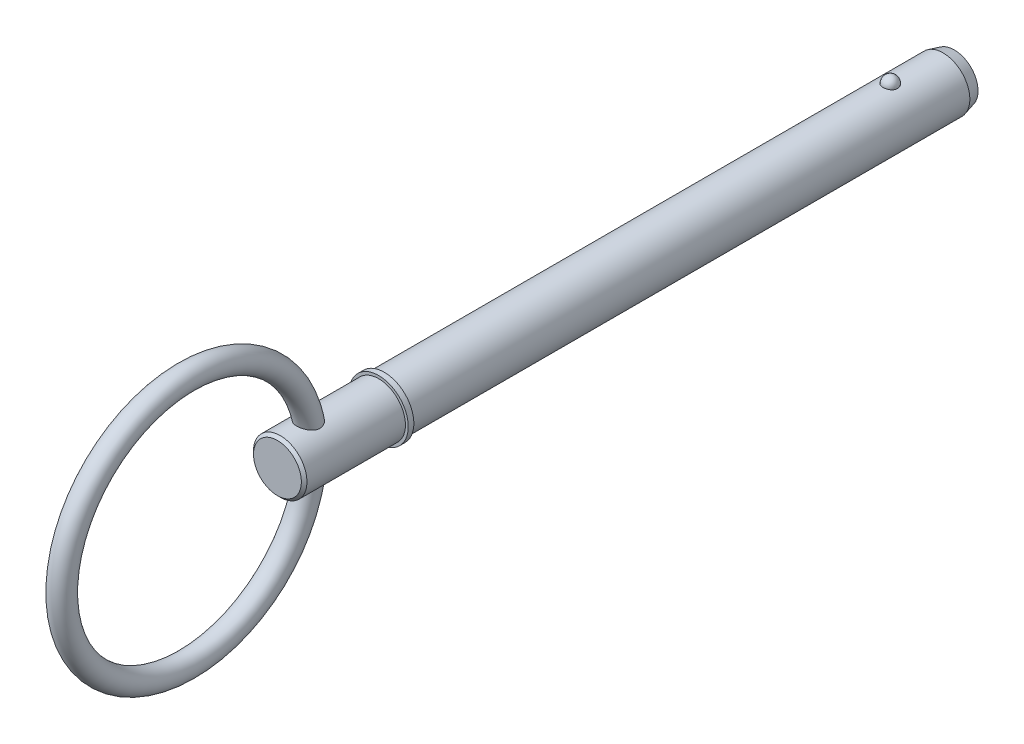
ISO-10303-21;
HEADER;
FILE_DESCRIPTION(('STEP AP214'),'2;1');
FILE_NAME('part.step','',(''),(''),'','','');
FILE_SCHEMA(('AUTOMOTIVE_DESIGN { 1 0 10303 214 1 1 1 1 }'));
ENDSEC;
DATA;
#1=APPLICATION_CONTEXT('core data for automotive mechanical design processes');
#2=APPLICATION_PROTOCOL_DEFINITION('international standard','automotive_design',2000,#1);
#3=PRODUCT_CONTEXT('',#1,'mechanical');
#4=PRODUCT('Part','Part','',(#3));
#5=PRODUCT_RELATED_PRODUCT_CATEGORY('part','',(#4));
#6=PRODUCT_DEFINITION_FORMATION('','',#4);
#7=PRODUCT_DEFINITION_CONTEXT('part definition',#1,'design');
#8=PRODUCT_DEFINITION('design','',#6,#7);
#9=PRODUCT_DEFINITION_SHAPE('','',#8);
#10=(LENGTH_UNIT() NAMED_UNIT(*) SI_UNIT(.MILLI.,.METRE.));
#11=(NAMED_UNIT(*) PLANE_ANGLE_UNIT() SI_UNIT($,.RADIAN.));
#12=(NAMED_UNIT(*) SI_UNIT($,.STERADIAN.) SOLID_ANGLE_UNIT());
#13=UNCERTAINTY_MEASURE_WITH_UNIT(LENGTH_MEASURE(1.E-05),#10,'distance_accuracy_value','');
#14=(GEOMETRIC_REPRESENTATION_CONTEXT(3) GLOBAL_UNCERTAINTY_ASSIGNED_CONTEXT((#13)) GLOBAL_UNIT_ASSIGNED_CONTEXT((#10,
#11,#12)) REPRESENTATION_CONTEXT('',''));
#15=CARTESIAN_POINT('',(0.,0.,0.));
#16=DIRECTION('',(0.,0.,1.));
#17=DIRECTION('',(1.,0.,0.));
#18=AXIS2_PLACEMENT_3D('',#15,#16,#17);
#19=CARTESIAN_POINT('',(0.,0.,88.9));
#20=DIRECTION('',(0.,0.,-1.));
#21=DIRECTION('',(-1.,0.,0.));
#22=AXIS2_PLACEMENT_3D('',#19,#20,#21);
#23=CYLINDRICAL_SURFACE('',#22,4.765);
#24=CARTESIAN_POINT('',(1.27812710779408,4.59038300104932,-1.29));
#25=CARTESIAN_POINT('',(1.27812572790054,4.59038414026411,-1.2178688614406));
#26=CARTESIAN_POINT('',(1.27223018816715,4.59203736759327,-1.14572000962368));
#27=CARTESIAN_POINT('',(1.24878929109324,4.59846646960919,-1.00346315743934));
#28=CARTESIAN_POINT('',(1.23123896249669,4.60324367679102,-0.933356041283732));
#29=CARTESIAN_POINT('',(1.18493861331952,4.61537801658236,-0.797215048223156));
#30=CARTESIAN_POINT('',(1.15619354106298,4.62273400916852,-0.731179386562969));
#31=CARTESIAN_POINT('',(1.08822596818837,4.6392032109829,-0.604986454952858));
#32=CARTESIAN_POINT('',(1.04900384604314,4.64831635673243,-0.544828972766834));
#33=CARTESIAN_POINT('',(0.960865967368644,4.66733302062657,-0.431775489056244));
#34=CARTESIAN_POINT('',(0.911906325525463,4.67723999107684,-0.378914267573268));
#35=CARTESIAN_POINT('',(0.805678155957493,4.69670280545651,-0.282245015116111));
#36=CARTESIAN_POINT('',(0.748409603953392,4.70625864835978,-0.238437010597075));
#37=CARTESIAN_POINT('',(0.627266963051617,4.72392767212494,-0.161207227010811));
#38=CARTESIAN_POINT('',(0.563411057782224,4.73204466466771,-0.127757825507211));
#39=CARTESIAN_POINT('',(0.430755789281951,4.74595788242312,-0.0720471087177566));
#40=CARTESIAN_POINT('',(0.361956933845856,4.75175434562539,-0.0497846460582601));
#41=CARTESIAN_POINT('',(0.222605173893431,4.76030056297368,-0.0173750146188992));
#42=CARTESIAN_POINT('',(0.152101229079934,4.76309991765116,-0.00703038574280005));
#43=CARTESIAN_POINT('',(0.0103009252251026,4.76551622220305,0.00191361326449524));
#44=CARTESIAN_POINT('',(-0.0609953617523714,4.76513345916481,0.000514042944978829));
#45=CARTESIAN_POINT('',(-0.201348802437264,4.76125496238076,-0.0138891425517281));
#46=CARTESIAN_POINT('',(-0.270423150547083,4.75780093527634,-0.0267372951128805));
#47=CARTESIAN_POINT('',(-0.405377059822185,4.74820737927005,-0.0634598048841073));
#48=CARTESIAN_POINT('',(-0.471256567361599,4.74206780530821,-0.0873343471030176));
#49=CARTESIAN_POINT('',(-0.598375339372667,4.72771507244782,-0.145611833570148));
#50=CARTESIAN_POINT('',(-0.659587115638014,4.71949070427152,-0.180071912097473));
#51=CARTESIAN_POINT('',(-0.775356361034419,4.70185936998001,-0.258542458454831));
#52=CARTESIAN_POINT('',(-0.8299131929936,4.69245229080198,-0.302553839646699));
#53=CARTESIAN_POINT('',(-0.931895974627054,4.67327936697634,-0.399829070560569));
#54=CARTESIAN_POINT('',(-0.979176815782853,4.66351011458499,-0.453244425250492));
#55=CARTESIAN_POINT('',(-1.06421220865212,4.64484426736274,-0.567321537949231));
#56=CARTESIAN_POINT('',(-1.10196613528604,4.63594772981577,-0.627983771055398));
#57=CARTESIAN_POINT('',(-1.16735225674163,4.61992036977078,-0.755585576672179));
#58=CARTESIAN_POINT('',(-1.19487251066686,4.61280933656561,-0.822585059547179));
#59=CARTESIAN_POINT('',(-1.23851975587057,4.60128324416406,-0.960417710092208));
#60=CARTESIAN_POINT('',(-1.25464705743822,4.59686811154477,-1.03125077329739));
#61=CARTESIAN_POINT('',(-1.27505790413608,4.59124882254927,-1.17443804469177));
#62=CARTESIAN_POINT('',(-1.27938868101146,4.59003186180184,-1.24678501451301));
#63=CARTESIAN_POINT('',(-1.27623192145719,4.5909105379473,-1.3911989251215));
#64=CARTESIAN_POINT('',(-1.26874468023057,4.59300609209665,-1.46326587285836));
#65=CARTESIAN_POINT('',(-1.24220427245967,4.60025423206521,-1.60473192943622));
#66=CARTESIAN_POINT('',(-1.2232043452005,4.60539274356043,-1.67414176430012));
#67=CARTESIAN_POINT('',(-1.17415910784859,4.61813957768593,-1.80870154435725));
#68=CARTESIAN_POINT('',(-1.1441133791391,4.62574799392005,-1.87385132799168));
#69=CARTESIAN_POINT('',(-1.07354327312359,4.64263368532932,-1.99841604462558));
#70=CARTESIAN_POINT('',(-1.03296580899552,4.65191934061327,-2.05779976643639));
#71=CARTESIAN_POINT('',(-0.942433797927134,4.67110036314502,-2.16881966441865));
#72=CARTESIAN_POINT('',(-0.892478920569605,4.68099575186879,-2.22045556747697));
#73=CARTESIAN_POINT('',(-0.784302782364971,4.70033161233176,-2.31471696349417));
#74=CARTESIAN_POINT('',(-0.726054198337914,4.70977043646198,-2.35731146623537));
#75=CARTESIAN_POINT('',(-0.602997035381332,4.72709995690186,-2.43206620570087));
#76=CARTESIAN_POINT('',(-0.538188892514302,4.73499075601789,-2.46422713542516));
#77=CARTESIAN_POINT('',(-0.404639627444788,4.7482563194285,-2.51687454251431));
#78=CARTESIAN_POINT('',(-0.335953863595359,4.7536596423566,-2.53749415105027));
#79=CARTESIAN_POINT('',(-0.195948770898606,4.76148510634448,-2.56703727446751));
#80=CARTESIAN_POINT('',(-0.124629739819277,4.76390758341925,-2.57596210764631));
#81=CARTESIAN_POINT('',(0.0172696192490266,4.76548774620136,-2.58180339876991));
#82=CARTESIAN_POINT('',(0.0878407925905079,4.76470225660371,-2.57892886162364));
#83=CARTESIAN_POINT('',(0.227467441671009,4.76008019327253,-2.56172603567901));
#84=CARTESIAN_POINT('',(0.296522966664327,4.75624371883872,-2.54739811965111));
#85=CARTESIAN_POINT('',(0.430942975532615,4.74595041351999,-2.50776251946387));
#86=CARTESIAN_POINT('',(0.496319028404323,4.7395023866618,-2.4824917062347));
#87=CARTESIAN_POINT('',(0.621860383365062,4.72467083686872,-2.4216730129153));
#88=CARTESIAN_POINT('',(0.682025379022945,4.71628720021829,-2.38612452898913));
#89=CARTESIAN_POINT('',(0.796409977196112,4.69833598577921,-2.30511163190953));
#90=CARTESIAN_POINT('',(0.850529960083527,4.68875291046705,-2.25951003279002));
#91=CARTESIAN_POINT('',(0.950412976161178,4.66953243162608,-2.15992428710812));
#92=CARTESIAN_POINT('',(0.996174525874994,4.65989501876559,-2.10593865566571));
#93=CARTESIAN_POINT('',(1.07885962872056,4.64145616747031,-1.99009376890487));
#94=CARTESIAN_POINT('',(1.11562789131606,4.63267081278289,-1.92812106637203));
#95=CARTESIAN_POINT('',(1.17840570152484,4.61710269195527,-1.79873681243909));
#96=CARTESIAN_POINT('',(1.20441973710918,4.61031909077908,-1.73132754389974));
#97=CARTESIAN_POINT('',(1.24242116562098,4.60021170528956,-1.60192906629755));
#98=CARTESIAN_POINT('',(1.25578772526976,4.59655387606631,-1.54036674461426));
#99=CARTESIAN_POINT('',(1.27364121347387,4.59163904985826,-1.41587409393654));
#100=CARTESIAN_POINT('',(1.2781283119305,4.59038200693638,-1.35294379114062));
#101=CARTESIAN_POINT('',(1.27812710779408,4.59038300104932,-1.29));
#102=B_SPLINE_CURVE_WITH_KNOTS('',3,(#24,#25,#26,#27,#28,#29,#30,#31,#32,#33,#34,#35,#36,#37,
#38,#39,#40,#41,#42,#43,#44,#45,#46,#47,#48,#49,#50,#51,#52,#53,#54,#55,#56,#57,#58,#59,#60,#61,
#62,#63,#64,#65,#66,#67,#68,#69,#70,#71,#72,#73,#74,#75,#76,#77,#78,#79,#80,#81,#82,#83,#84,#85,
#86,#87,#88,#89,#90,#91,#92,#93,#94,#95,#96,#97,#98,#99,#100,#101),.UNSPECIFIED.,.T.,.F.,(4,2,2,
2,2,2,2,2,2,2,2,2,2,2,2,2,2,2,2,2,2,2,2,2,2,2,2,2,2,2,2,2,2,2,2,2,2,2,4),(0.,0.216167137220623,
0.432426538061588,0.648590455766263,0.864746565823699,1.0818998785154,1.29905382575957,
1.51562361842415,1.73217119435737,1.94507683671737,2.15796327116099,2.36800220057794,
2.57804465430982,2.78924132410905,3.00045819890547,3.21545551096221,3.43046692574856,
3.64776550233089,3.8650581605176,4.08147951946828,4.29789547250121,4.51331818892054,
4.72874907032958,4.94528769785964,5.16183395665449,5.37911087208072,5.59637335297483,
5.8110751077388,6.02575265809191,6.23664413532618,6.44752874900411,6.65770827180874,
6.86790014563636,7.08116060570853,7.29445887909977,7.51121476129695,7.72788009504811,
7.91651762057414,8.10515153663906),.UNSPECIFIED.);
#103=CARTESIAN_POINT('',(1.27812710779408,4.59038300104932,-1.29));
#104=VERTEX_POINT('',#103);
#105=EDGE_CURVE('E102',#104,#104,#102,.T.);
#106=ORIENTED_EDGE('',*,*,#105,.T.);
#107=EDGE_LOOP('',(#106));
#108=FACE_BOUND('',#107,.T.);
#109=CARTESIAN_POINT('',(0.,0.,-10.7));
#110=DIRECTION('',(0.,0.,-1.));
#111=DIRECTION('',(-1.,0.,0.));
#112=AXIS2_PLACEMENT_3D('',#109,#110,#111);
#113=CIRCLE('',#112,4.765);
#114=CARTESIAN_POINT('',(-4.765,0.,-10.7));
#115=VERTEX_POINT('',#114);
#116=EDGE_CURVE('E110',#115,#115,#113,.F.);
#117=ORIENTED_EDGE('',*,*,#116,.T.);
#118=EDGE_LOOP('',(#117));
#119=FACE_BOUND('',#118,.T.);
#120=CARTESIAN_POINT('',(0.,0.,88.9));
#121=DIRECTION('',(0.,0.,1.));
#122=DIRECTION('',(1.,0.,0.));
#123=AXIS2_PLACEMENT_3D('',#120,#121,#122);
#124=CIRCLE('',#123,4.765);
#125=CARTESIAN_POINT('',(4.765,0.,88.9));
#126=VERTEX_POINT('',#125);
#127=EDGE_CURVE('E108',#126,#126,#124,.T.);
#128=ORIENTED_EDGE('',*,*,#127,.F.);
#129=EDGE_LOOP('',(#128));
#130=FACE_BOUND('',#129,.T.);
#131=ADVANCED_FACE('F39',(#108,#119,#130),#23,.T.);
#132=CARTESIAN_POINT('',(0.,0.,-12.7));
#133=DIRECTION('',(0.,0.,-1.));
#134=DIRECTION('',(-1.,0.,0.));
#135=AXIS2_PLACEMENT_3D('',#132,#133,#134);
#136=PLANE('',#135);
#137=CARTESIAN_POINT('',(0.,0.,-12.7));
#138=DIRECTION('',(0.,0.,-1.));
#139=DIRECTION('',(-1.,0.,0.));
#140=AXIS2_PLACEMENT_3D('',#137,#138,#139);
#141=CIRCLE('',#140,4.22910161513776);
#142=CARTESIAN_POINT('',(-4.22910161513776,0.,-12.7));
#143=VERTEX_POINT('',#142);
#144=EDGE_CURVE('E143',#143,#143,#141,.T.);
#145=ORIENTED_EDGE('',*,*,#144,.T.);
#146=EDGE_LOOP('',(#145));
#147=FACE_BOUND('',#146,.T.);
#148=ADVANCED_FACE('F88',(#147),#136,.T.);
#149=CARTESIAN_POINT('',(0.,0.,-12.7));
#150=DIRECTION('',(0.,0.,1.));
#151=DIRECTION('',(1.,0.,0.));
#152=AXIS2_PLACEMENT_3D('',#149,#150,#151);
#153=CONICAL_SURFACE('',#152,4.22910161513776,0.261799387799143);
#154=ORIENTED_EDGE('',*,*,#116,.F.);
#155=EDGE_LOOP('',(#154));
#156=FACE_BOUND('',#155,.T.);
#157=ORIENTED_EDGE('',*,*,#144,.F.);
#158=EDGE_LOOP('',(#157));
#159=FACE_BOUND('',#158,.T.);
#160=ADVANCED_FACE('F94',(#156,#159),#153,.T.);
#161=CARTESIAN_POINT('',(0.,4.765,-1.29));
#162=DIRECTION('',(0.,1.,0.));
#163=DIRECTION('',(0.,0.,-1.));
#164=AXIS2_PLACEMENT_3D('',#161,#162,#163);
#165=SPHERICAL_SURFACE('',#164,1.29);
#166=ORIENTED_EDGE('',*,*,#105,.F.);
#167=EDGE_LOOP('',(#166));
#168=FACE_BOUND('',#167,.T.);
#169=ADVANCED_FACE('F113',(#168),#165,.T.);
#170=CARTESIAN_POINT('',(0.,0.,88.9));
#171=DIRECTION('',(0.,0.,-1.));
#172=DIRECTION('',(-1.,0.,0.));
#173=AXIS2_PLACEMENT_3D('',#170,#171,#172);
#174=PLANE('',#173);
#175=ORIENTED_EDGE('',*,*,#127,.T.);
#176=EDGE_LOOP('',(#175));
#177=FACE_BOUND('',#176,.T.);
#178=CARTESIAN_POINT('',(0.,0.,88.9));
#179=DIRECTION('',(0.,0.,-1.));
#180=DIRECTION('',(-1.,0.,0.));
#181=AXIS2_PLACEMENT_3D('',#178,#179,#180);
#182=CIRCLE('',#181,5.265);
#183=CARTESIAN_POINT('',(-5.265,0.,88.9));
#184=VERTEX_POINT('',#183);
#185=EDGE_CURVE('E109',#184,#184,#182,.T.);
#186=ORIENTED_EDGE('',*,*,#185,.T.);
#187=EDGE_LOOP('',(#186));
#188=FACE_BOUND('',#187,.T.);
#189=ADVANCED_FACE('F117',(#177,#188),#174,.T.);
#190=CARTESIAN_POINT('',(0.,0.,33.7287874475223));
#191=DIRECTION('',(0.,0.,-1.));
#192=DIRECTION('',(-1.,0.,0.));
#193=AXIS2_PLACEMENT_3D('',#190,#191,#192);
#194=CYLINDRICAL_SURFACE('',#193,5.265);
#195=CARTESIAN_POINT('',(0.,0.,89.9));
#196=DIRECTION('',(0.,0.,-1.));
#197=DIRECTION('',(-1.,0.,0.));
#198=AXIS2_PLACEMENT_3D('',#195,#196,#197);
#199=CIRCLE('',#198,5.265);
#200=CARTESIAN_POINT('',(-5.265,0.,89.9));
#201=VERTEX_POINT('',#200);
#202=EDGE_CURVE('E134',#201,#201,#199,.T.);
#203=ORIENTED_EDGE('',*,*,#202,.T.);
#204=EDGE_LOOP('',(#203));
#205=FACE_BOUND('',#204,.T.);
#206=ORIENTED_EDGE('',*,*,#185,.F.);
#207=EDGE_LOOP('',(#206));
#208=FACE_BOUND('',#207,.T.);
#209=ADVANCED_FACE('F121',(#205,#208),#194,.T.);
#210=CARTESIAN_POINT('',(0.,5.265,89.9));
#211=DIRECTION('',(0.,0.,1.));
#212=DIRECTION('',(1.,0.,0.));
#213=AXIS2_PLACEMENT_3D('',#210,#211,#212);
#214=PLANE('',#213);
#215=CARTESIAN_POINT('',(0.,0.,89.9));
#216=DIRECTION('',(0.,0.,1.));
#217=DIRECTION('',(1.,0.,0.));
#218=AXIS2_PLACEMENT_3D('',#215,#216,#217);
#219=CIRCLE('',#218,4.765);
#220=CARTESIAN_POINT('',(4.765,0.,89.9));
#221=VERTEX_POINT('',#220);
#222=EDGE_CURVE('E112',#221,#221,#219,.T.);
#223=ORIENTED_EDGE('',*,*,#222,.F.);
#224=EDGE_LOOP('',(#223));
#225=FACE_BOUND('',#224,.T.);
#226=ORIENTED_EDGE('',*,*,#202,.F.);
#227=EDGE_LOOP('',(#226));
#228=FACE_BOUND('',#227,.T.);
#229=ADVANCED_FACE('F85',(#225,#228),#214,.T.);
#230=CARTESIAN_POINT('',(0.,0.,107.95));
#231=DIRECTION('',(0.,0.,-1.));
#232=DIRECTION('',(-1.,0.,0.));
#233=AXIS2_PLACEMENT_3D('',#230,#231,#232);
#234=CYLINDRICAL_SURFACE('',#233,4.765);
#235=CARTESIAN_POINT('',(-1.17603588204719,-4.61759294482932,100.78372006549));
#236=CARTESIAN_POINT('',(-1.08605054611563,-4.6405075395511,100.7215688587));
#237=CARTESIAN_POINT('',(-0.990486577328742,-4.66202408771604,100.66673933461));
#238=CARTESIAN_POINT('',(-0.790762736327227,-4.70002969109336,100.572995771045));
#239=CARTESIAN_POINT('',(-0.686587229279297,-4.7165093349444,100.534111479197));
#240=CARTESIAN_POINT('',(-0.472539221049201,-4.7427361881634,100.473267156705));
#241=CARTESIAN_POINT('',(-0.362665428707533,-4.75248186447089,100.451310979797));
#242=CARTESIAN_POINT('',(-0.140482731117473,-4.7642267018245,100.424936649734));
#243=CARTESIAN_POINT('',(-0.0281752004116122,-4.7662301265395,100.420508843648));
#244=CARTESIAN_POINT('',(0.193745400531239,-4.76233166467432,100.429208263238));
#245=CARTESIAN_POINT('',(0.303372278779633,-4.75656024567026,100.442045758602));
#246=CARTESIAN_POINT('',(0.518724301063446,-4.73791484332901,100.484434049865));
#247=CARTESIAN_POINT('',(0.624448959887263,-4.72503997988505,100.513986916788));
#248=CARTESIAN_POINT('',(0.829434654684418,-4.69340588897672,100.58920858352));
#249=CARTESIAN_POINT('',(0.928674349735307,-4.6746283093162,100.634927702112));
#250=CARTESIAN_POINT('',(1.11777413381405,-4.63305392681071,100.741473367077));
#251=CARTESIAN_POINT('',(1.20763216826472,-4.61025624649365,100.802303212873));
#252=CARTESIAN_POINT('',(1.37762760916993,-4.56238439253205,100.939439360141));
#253=CARTESIAN_POINT('',(1.45749020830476,-4.53726959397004,101.01607281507));
#254=CARTESIAN_POINT('',(1.60275140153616,-4.48801828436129,101.182293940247));
#255=CARTESIAN_POINT('',(1.66815155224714,-4.46388166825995,101.271880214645));
#256=CARTESIAN_POINT('',(1.78162069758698,-4.41980966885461,101.460468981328));
#257=CARTESIAN_POINT('',(1.82993675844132,-4.3998162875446,101.559308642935));
#258=CARTESIAN_POINT('',(1.90902953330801,-4.36608532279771,101.764739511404));
#259=CARTESIAN_POINT('',(1.93981696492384,-4.35234391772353,101.871325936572));
#260=CARTESIAN_POINT('',(1.9818112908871,-4.33337618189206,102.082380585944));
#261=CARTESIAN_POINT('',(1.99406945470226,-4.32769391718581,102.18660066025));
#262=CARTESIAN_POINT('',(2.0025484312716,-4.32377679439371,102.395812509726));
#263=CARTESIAN_POINT('',(1.99876733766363,-4.32554282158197,102.500804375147));
#264=CARTESIAN_POINT('',(1.97595504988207,-4.33600911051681,102.709105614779));
#265=CARTESIAN_POINT('',(1.95686739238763,-4.3447350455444,102.812407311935));
#266=CARTESIAN_POINT('',(1.90457346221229,-4.36790947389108,103.014679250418));
#267=CARTESIAN_POINT('',(1.87136191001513,-4.38236010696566,103.113647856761));
#268=CARTESIAN_POINT('',(1.78747856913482,-4.41728816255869,103.316470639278));
#269=CARTESIAN_POINT('',(1.73524632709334,-4.43826528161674,103.419592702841));
#270=CARTESIAN_POINT('',(1.61607256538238,-4.48303292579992,103.616386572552));
#271=CARTESIAN_POINT('',(1.5491157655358,-4.50682636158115,103.710048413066));
#272=CARTESIAN_POINT('',(1.39359064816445,-4.55746895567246,103.895383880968));
#273=CARTESIAN_POINT('',(1.30346928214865,-4.58437060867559,103.985750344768));
#274=CARTESIAN_POINT('',(1.10794390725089,-4.6354985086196,104.149011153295));
#275=CARTESIAN_POINT('',(1.00255934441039,-4.65972809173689,104.221927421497));
#276=CARTESIAN_POINT('',(0.803761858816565,-4.69755503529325,104.332407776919));
#277=CARTESIAN_POINT('',(0.712935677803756,-4.71231838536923,104.374230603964));
#278=CARTESIAN_POINT('',(0.525172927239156,-4.73691370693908,104.442936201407));
#279=CARTESIAN_POINT('',(0.428242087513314,-4.7467502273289,104.469832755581));
#280=CARTESIAN_POINT('',(0.230351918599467,-4.76046566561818,104.50714705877));
#281=CARTESIAN_POINT('',(0.129376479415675,-4.76431768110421,104.517490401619));
#282=CARTESIAN_POINT('',(-0.0728965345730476,-4.76551495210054,104.520716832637));
#283=CARTESIAN_POINT('',(-0.174194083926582,-4.76286070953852,104.51360126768));
#284=CARTESIAN_POINT('',(-0.366467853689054,-4.751792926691,104.483579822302));
#285=CARTESIAN_POINT('',(-0.45765922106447,-4.74381187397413,104.461858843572));
#286=CARTESIAN_POINT('',(-0.635226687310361,-4.72331548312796,104.405084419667));
#287=CARTESIAN_POINT('',(-0.721601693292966,-4.71079912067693,104.370027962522));
#288=CARTESIAN_POINT('',(-0.893212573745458,-4.68139468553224,104.285559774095));
#289=CARTESIAN_POINT('',(-0.978027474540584,-4.66427939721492,104.235377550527));
#290=CARTESIAN_POINT('',(-1.13917803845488,-4.62756330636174,104.123642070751));
#291=CARTESIAN_POINT('',(-1.21550961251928,-4.6079613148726,104.062083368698));
#292=CARTESIAN_POINT('',(-1.37033540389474,-4.56452178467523,103.91868852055));
#293=CARTESIAN_POINT('',(-1.44723650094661,-4.5405070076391,103.835184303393));
#294=CARTESIAN_POINT('',(-1.58763850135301,-4.49334232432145,103.657292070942));
#295=CARTESIAN_POINT('',(-1.65112672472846,-4.47019325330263,103.562893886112));
#296=CARTESIAN_POINT('',(-1.77033243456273,-4.42444393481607,103.353206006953));
#297=CARTESIAN_POINT('',(-1.82420433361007,-4.40224259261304,103.236768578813));
#298=CARTESIAN_POINT('',(-1.91169086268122,-4.36496831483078,102.995409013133));
#299=CARTESIAN_POINT('',(-1.94531523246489,-4.34989195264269,102.870490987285));
#300=CARTESIAN_POINT('',(-1.98892523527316,-4.33012255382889,102.622016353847));
#301=CARTESIAN_POINT('',(-1.99998275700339,-4.32495941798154,102.498689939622));
#302=CARTESIAN_POINT('',(-2.00001713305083,-4.32494814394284,102.252073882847));
#303=CARTESIAN_POINT('',(-1.98902141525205,-4.33008719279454,102.128784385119));
#304=CARTESIAN_POINT('',(-1.94752572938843,-4.34888267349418,101.90321378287));
#305=CARTESIAN_POINT('',(-1.9197975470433,-4.36132278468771,101.800310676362));
#306=CARTESIAN_POINT('',(-1.84805595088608,-4.39220107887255,101.601251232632));
#307=CARTESIAN_POINT('',(-1.80403476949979,-4.4106421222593,101.505098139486));
#308=CARTESIAN_POINT('',(-1.70232000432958,-4.45086896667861,101.324457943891));
#309=CARTESIAN_POINT('',(-1.64499853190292,-4.47255887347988,101.239738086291));
#310=CARTESIAN_POINT('',(-1.51770958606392,-4.51733419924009,101.081012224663));
#311=CARTESIAN_POINT('',(-1.44776268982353,-4.54041730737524,101.006989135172));
#312=CARTESIAN_POINT('',(-1.34143544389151,-4.57239833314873,100.91104340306));
#313=CARTESIAN_POINT('',(-1.30955259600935,-4.58164274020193,100.884115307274));
#314=CARTESIAN_POINT('',(-1.24406394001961,-4.59985727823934,100.832340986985));
#315=CARTESIAN_POINT('',(-1.21045807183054,-4.6088273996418,100.80749483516));
#316=CARTESIAN_POINT('',(-1.17603588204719,-4.61759294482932,100.78372006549));
#317=B_SPLINE_CURVE_WITH_KNOTS('',3,(#235,#236,#237,#238,#239,#240,#241,#242,#243,#244,#245,
#246,#247,#248,#249,#250,#251,#252,#253,#254,#255,#256,#257,#258,#259,#260,#261,#262,#263,#264,
#265,#266,#267,#268,#269,#270,#271,#272,#273,#274,#275,#276,#277,#278,#279,#280,#281,#282,#283,
#284,#285,#286,#287,#288,#289,#290,#291,#292,#293,#294,#295,#296,#297,#298,#299,#300,#301,#302,
#303,#304,#305,#306,#307,#308,#309,#310,#311,#312,#313,#314,#315,#316),.UNSPECIFIED.,.T.,.F.,(4,
2,2,2,2,2,2,2,2,2,2,2,2,2,2,2,2,2,2,2,2,2,2,2,2,2,2,2,2,2,2,2,2,2,2,2,2,2,2,2,4),(0.,
0.335054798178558,0.67073186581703,1.00648532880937,1.34205386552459,1.67206089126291,
2.00210881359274,2.33319321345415,2.66434996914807,3.00321157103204,3.34203668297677,
3.67573940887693,4.00923787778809,4.32299322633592,4.63678586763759,4.95174139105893,
5.26681474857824,5.61785759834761,5.96926647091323,6.35862694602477,6.74749565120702,
7.04947204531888,7.35116911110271,7.6542185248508,7.9572445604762,8.23825252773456,
8.51932400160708,8.81825171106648,9.11732288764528,9.46404422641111,9.811091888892,
10.1997682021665,10.5882573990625,10.9578189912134,11.3269212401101,11.6472091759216,
11.9676500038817,12.2800235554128,12.5918925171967,12.7200569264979,12.8482258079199),.UNSPECIFIED.);
#318=CARTESIAN_POINT('',(-1.17603588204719,-4.61759294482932,100.78372006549));
#319=VERTEX_POINT('',#318);
#320=EDGE_CURVE('E10',#319,#319,#317,.T.);
#321=ORIENTED_EDGE('',*,*,#320,.F.);
#322=EDGE_LOOP('',(#321));
#323=FACE_BOUND('',#322,.T.);
#324=CARTESIAN_POINT('',(-1.17603588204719,4.61759294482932,100.78372006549));
#325=CARTESIAN_POINT('',(-1.26499234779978,4.59493450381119,100.845169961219));
#326=CARTESIAN_POINT('',(-1.34870034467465,4.57085993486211,100.913915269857));
#327=CARTESIAN_POINT('',(-1.50334626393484,4.52236448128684,101.064635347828));
#328=CARTESIAN_POINT('',(-1.57425996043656,4.49794303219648,101.146634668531));
#329=CARTESIAN_POINT('',(-1.7013018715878,4.45144771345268,101.322234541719));
#330=CARTESIAN_POINT('',(-1.75740699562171,4.42937754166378,101.41585288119));
#331=CARTESIAN_POINT('',(-1.85287755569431,4.3903018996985,101.6121668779));
#332=CARTESIAN_POINT('',(-1.89225871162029,4.37329167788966,101.714853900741));
#333=CARTESIAN_POINT('',(-1.95188661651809,4.34699775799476,101.921857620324));
#334=CARTESIAN_POINT('',(-1.97286468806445,4.33742068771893,102.025926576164));
#335=CARTESIAN_POINT('',(-1.99814509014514,4.32583397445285,102.236471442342));
#336=CARTESIAN_POINT('',(-2.00244696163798,4.32382453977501,102.342947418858));
#337=CARTESIAN_POINT('',(-1.99499900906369,4.32726361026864,102.552770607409));
#338=CARTESIAN_POINT('',(-1.9836061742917,4.33254625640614,102.656134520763));
#339=CARTESIAN_POINT('',(-1.94643618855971,4.34936983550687,102.859691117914));
#340=CARTESIAN_POINT('',(-1.92065444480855,4.3609127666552,102.959882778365));
#341=CARTESIAN_POINT('',(-1.85292379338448,4.3901452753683,103.16410420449));
#342=CARTESIAN_POINT('',(-1.80971134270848,4.40830066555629,103.267646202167));
#343=CARTESIAN_POINT('',(-1.70892742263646,4.44833985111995,103.466768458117));
#344=CARTESIAN_POINT('',(-1.65134284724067,4.47022704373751,103.562341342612));
#345=CARTESIAN_POINT('',(-1.51475300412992,4.51847764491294,103.755260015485));
#346=CARTESIAN_POINT('',(-1.43395667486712,4.54505660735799,103.851291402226));
#347=CARTESIAN_POINT('',(-1.25684082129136,4.59718102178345,104.028132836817));
#348=CARTESIAN_POINT('',(-1.16053129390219,4.62272712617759,104.108952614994));
#349=CARTESIAN_POINT('',(-0.972192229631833,4.66558476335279,104.239326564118));
#350=CARTESIAN_POINT('',(-0.882391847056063,4.68355428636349,104.291879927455));
#351=CARTESIAN_POINT('',(-0.694836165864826,4.71502283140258,104.382022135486));
#352=CARTESIAN_POINT('',(-0.597087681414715,4.72852563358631,104.419623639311));
#353=CARTESIAN_POINT('',(-0.395321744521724,4.74966109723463,104.477875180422));
#354=CARTESIAN_POINT('',(-0.29126929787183,4.7572569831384,104.498419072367));
#355=CARTESIAN_POINT('',(-0.0808979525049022,4.76547327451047,104.520624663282));
#356=CARTESIAN_POINT('',(0.0254198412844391,4.76609700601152,104.52229536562));
#357=CARTESIAN_POINT('',(0.225327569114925,4.7606097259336,104.507485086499));
#358=CARTESIAN_POINT('',(0.319084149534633,4.75519734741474,104.492887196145));
#359=CARTESIAN_POINT('',(0.502750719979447,4.73930039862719,104.449397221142));
#360=CARTESIAN_POINT('',(0.592660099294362,4.7288150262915,104.420502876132));
#361=CARTESIAN_POINT('',(0.768777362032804,4.70343779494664,104.34904136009));
#362=CARTESIAN_POINT('',(0.854839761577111,4.68844387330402,104.306155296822));
#363=CARTESIAN_POINT('',(1.01943666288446,4.65543047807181,104.208746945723));
#364=CARTESIAN_POINT('',(1.09796821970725,4.63740982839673,104.154220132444));
#365=CARTESIAN_POINT('',(1.25751825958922,4.59691257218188,104.026465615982));
#366=CARTESIAN_POINT('',(1.33721103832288,4.57417011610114,103.951667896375));
#367=CARTESIAN_POINT('',(1.48461190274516,4.52847869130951,103.791082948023));
#368=CARTESIAN_POINT('',(1.55230949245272,4.50552956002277,103.705286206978));
#369=CARTESIAN_POINT('',(1.68366050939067,4.45825797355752,103.511404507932));
#370=CARTESIAN_POINT('',(1.74532014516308,4.43421533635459,103.401889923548));
#371=CARTESIAN_POINT('',(1.85007805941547,4.39154308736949,103.173269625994));
#372=CARTESIAN_POINT('',(1.89317429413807,4.37291407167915,103.054162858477));
#373=CARTESIAN_POINT('',(1.958572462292,4.34402041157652,102.809763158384));
#374=CARTESIAN_POINT('',(1.98095022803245,4.33372528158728,102.684494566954));
#375=CARTESIAN_POINT('',(2.00301292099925,4.32358016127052,102.431594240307));
#376=CARTESIAN_POINT('',(2.00273000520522,4.32371536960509,102.303966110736));
#377=CARTESIAN_POINT('',(1.97997568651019,4.3341693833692,102.068247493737));
#378=CARTESIAN_POINT('',(1.96044562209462,4.34313814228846,101.959806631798));
#379=CARTESIAN_POINT('',(1.903681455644,4.3683153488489,101.748543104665));
#380=CARTESIAN_POINT('',(1.86644884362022,4.38452318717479,101.645719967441));
#381=CARTESIAN_POINT('',(1.77811542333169,4.42104679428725,101.45471002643));
#382=CARTESIAN_POINT('',(1.72797707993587,4.44105894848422,101.366015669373));
#383=CARTESIAN_POINT('',(1.61439500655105,4.48359504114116,101.198286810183));
#384=CARTESIAN_POINT('',(1.55094927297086,4.50611935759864,101.119253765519));
#385=CARTESIAN_POINT('',(1.40889349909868,4.55259151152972,100.968705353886));
#386=CARTESIAN_POINT('',(1.32968750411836,4.57655455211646,100.897757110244));
#387=CARTESIAN_POINT('',(1.16035884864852,4.62238936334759,100.769506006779));
#388=CARTESIAN_POINT('',(1.07023361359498,4.64426063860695,100.71220637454));
#389=CARTESIAN_POINT('',(0.877362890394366,4.68460759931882,100.610316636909));
#390=CARTESIAN_POINT('',(0.774249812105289,4.70290564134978,100.566349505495));
#391=CARTESIAN_POINT('',(0.561430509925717,4.73302876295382,100.495484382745));
#392=CARTESIAN_POINT('',(0.451725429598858,4.74485496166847,100.468583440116));
#393=CARTESIAN_POINT('',(0.230282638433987,4.76071009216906,100.432763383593));
#394=CARTESIAN_POINT('',(0.11858761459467,4.76483485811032,100.423623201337));
#395=CARTESIAN_POINT('',(-0.104911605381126,4.76515532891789,100.422908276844));
#396=CARTESIAN_POINT('',(-0.216715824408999,4.76134861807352,100.431338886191));
#397=CARTESIAN_POINT('',(-0.435231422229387,4.74632552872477,100.46524563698));
#398=CARTESIAN_POINT('',(-0.541996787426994,4.73523460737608,100.490433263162));
#399=CARTESIAN_POINT('',(-0.749371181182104,4.70686626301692,100.556921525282));
#400=CARTESIAN_POINT('',(-0.849990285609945,4.68959930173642,100.598194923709));
#401=CARTESIAN_POINT('',(-0.986108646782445,4.6620261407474,100.667235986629));
#402=CARTESIAN_POINT('',(-1.0252576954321,4.65355983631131,100.688772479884));
#403=CARTESIAN_POINT('',(-1.10191286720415,4.63600664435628,100.734367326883));
#404=CARTESIAN_POINT('',(-1.13941901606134,4.62691976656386,100.758425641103));
#405=CARTESIAN_POINT('',(-1.17603588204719,4.61759294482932,100.78372006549));
#406=B_SPLINE_CURVE_WITH_KNOTS('',3,(#324,#325,#326,#327,#328,#329,#330,#331,#332,#333,#334,
#335,#336,#337,#338,#339,#340,#341,#342,#343,#344,#345,#346,#347,#348,#349,#350,#351,#352,#353,
#354,#355,#356,#357,#358,#359,#360,#361,#362,#363,#364,#365,#366,#367,#368,#369,#370,#371,#372,
#373,#374,#375,#376,#377,#378,#379,#380,#381,#382,#383,#384,#385,#386,#387,#388,#389,#390,#391,
#392,#393,#394,#395,#396,#397,#398,#399,#400,#401,#402,#403,#404,#405),.UNSPECIFIED.,.T.,.F.,(4,
2,2,2,2,2,2,2,2,2,2,2,2,2,2,2,2,2,2,2,2,2,2,2,2,2,2,2,2,2,2,2,2,2,2,2,2,2,2,2,4),(0.,
0.331234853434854,0.663090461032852,0.995460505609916,1.3275174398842,1.64568783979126,
1.96386699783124,2.27492717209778,2.58608669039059,2.92571998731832,3.26566413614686,
3.64875195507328,4.0315938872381,4.34706664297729,4.66227172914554,4.97942386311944,
5.29642469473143,5.58021908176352,5.86405835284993,6.15488068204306,6.44581627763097,
6.77943874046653,7.11335170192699,7.49545660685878,7.87760356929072,8.25834622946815,
8.63854860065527,8.96843568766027,9.29829501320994,9.60842872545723,9.91860916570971,
10.2441707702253,10.5698092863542,10.9089029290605,11.2479379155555,11.5827251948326,
11.9176144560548,12.2468820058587,12.5755944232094,12.7119417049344,12.8482868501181),.UNSPECIFIED.);
#407=CARTESIAN_POINT('',(-1.17603588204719,4.61759294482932,100.78372006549));
#408=VERTEX_POINT('',#407);
#409=EDGE_CURVE('E51',#408,#408,#406,.T.);
#410=ORIENTED_EDGE('',*,*,#409,.F.);
#411=EDGE_LOOP('',(#410));
#412=FACE_BOUND('',#411,.T.);
#413=CARTESIAN_POINT('',(0.,0.,107.45));
#414=DIRECTION('',(0.,0.,-1.));
#415=DIRECTION('',(-1.,0.,0.));
#416=AXIS2_PLACEMENT_3D('',#413,#414,#415);
#417=CIRCLE('',#416,4.765);
#418=CARTESIAN_POINT('',(-4.765,0.,107.45));
#419=VERTEX_POINT('',#418);
#420=EDGE_CURVE('E64',#419,#419,#417,.T.);
#421=ORIENTED_EDGE('',*,*,#420,.T.);
#422=EDGE_LOOP('',(#421));
#423=FACE_BOUND('',#422,.T.);
#424=ORIENTED_EDGE('',*,*,#222,.T.);
#425=EDGE_LOOP('',(#424));
#426=FACE_BOUND('',#425,.T.);
#427=ADVANCED_FACE('F69',(#323,#412,#423,#426),#234,.T.);
#428=CARTESIAN_POINT('',(0.,0.,107.95));
#429=DIRECTION('',(0.,0.,-1.));
#430=DIRECTION('',(-1.,0.,0.));
#431=AXIS2_PLACEMENT_3D('',#428,#429,#430);
#432=PLANE('',#431);
#433=CARTESIAN_POINT('',(0.,0.,107.95));
#434=DIRECTION('',(0.,0.,-1.));
#435=DIRECTION('',(-1.,0.,0.));
#436=AXIS2_PLACEMENT_3D('',#433,#434,#435);
#437=CIRCLE('',#436,4.26499999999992);
#438=CARTESIAN_POINT('',(-4.26499999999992,0.,107.95));
#439=VERTEX_POINT('',#438);
#440=EDGE_CURVE('E58',#439,#439,#437,.F.);
#441=ORIENTED_EDGE('',*,*,#440,.T.);
#442=EDGE_LOOP('',(#441));
#443=FACE_BOUND('',#442,.T.);
#444=ADVANCED_FACE('F76',(#443),#432,.F.);
#445=CARTESIAN_POINT('',(0.,0.,107.45));
#446=DIRECTION('',(0.,0.,-1.));
#447=DIRECTION('',(-1.,0.,0.));
#448=AXIS2_PLACEMENT_3D('',#445,#446,#447);
#449=CONICAL_SURFACE('',#448,4.765,0.785398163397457);
#450=ORIENTED_EDGE('',*,*,#440,.F.);
#451=EDGE_LOOP('',(#450));
#452=FACE_BOUND('',#451,.T.);
#453=ORIENTED_EDGE('',*,*,#420,.F.);
#454=EDGE_LOOP('',(#453));
#455=FACE_BOUND('',#454,.T.);
#456=ADVANCED_FACE('F41',(#452,#455),#449,.T.);
#457=CARTESIAN_POINT('',(0.,0.,124.175));
#458=DIRECTION('',(1.,0.,0.));
#459=DIRECTION('',(0.,0.,-1.));
#460=AXIS2_PLACEMENT_3D('',#457,#458,#459);
#461=TOROIDAL_SURFACE('',#460,22.225,2.);
#462=ORIENTED_EDGE('',*,*,#320,.T.);
#463=EDGE_LOOP('',(#462));
#464=FACE_BOUND('',#463,.T.);
#465=ORIENTED_EDGE('',*,*,#409,.T.);
#466=EDGE_LOOP('',(#465));
#467=FACE_BOUND('',#466,.T.);
#468=ADVANCED_FACE('F73',(#464,#467),#461,.T.);
#469=CLOSED_SHELL('',(#131,#148,#160,#169,#189,#209,#229,#427,#444,#456,#468));
#470=MANIFOLD_SOLID_BREP('B2',#469);
#471=ADVANCED_BREP_SHAPE_REPRESENTATION('',(#18,#470),#14);
#472=SHAPE_DEFINITION_REPRESENTATION(#9,#471);
ENDSEC;
END-ISO-10303-21;
